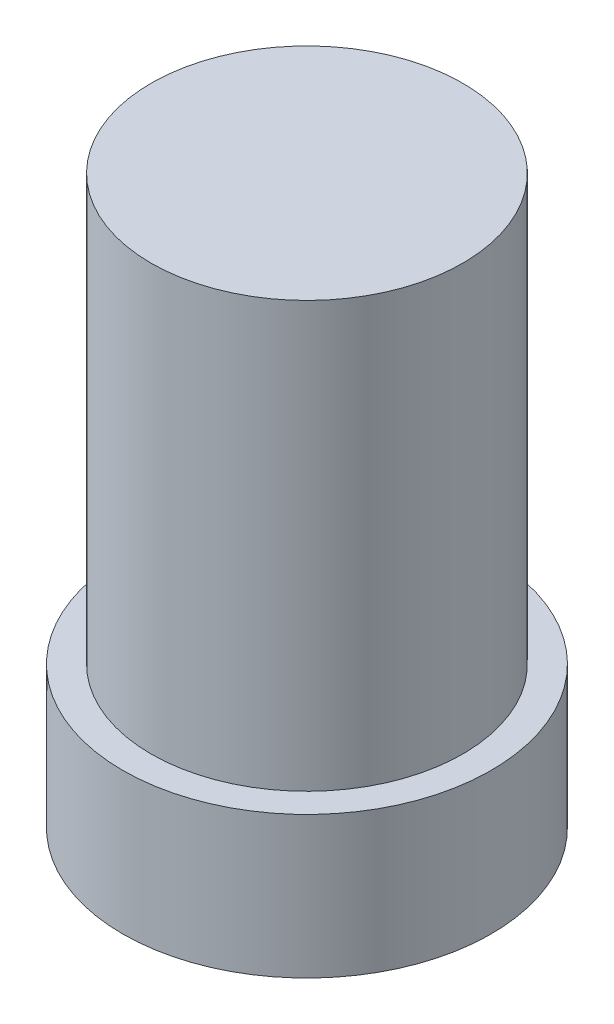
from build123d import *

# Parameters (mm, degrees)
SKETCH1_R           = 6.5
BOSS_EXTRUDE1_DEPTH = 5
SKETCH2_R           = 5.5
BOSS_EXTRUDE2_DEPTH = 15
SKETCH3_R           = 6
CUT_EXTRUDE1_DEPTH  = 4


with BuildPart() as part:
    # Sketch1 → Boss-Extrude1 (new body)
    with BuildSketch(Plane(origin=(0, 0, 0), x_dir=(1, 0, 0), z_dir=(0, 1, 0))):
        with Locations(Location((0, 0, 0), (0, 0, 270))):
            Circle(SKETCH1_R)
    extrude(amount=BOSS_EXTRUDE1_DEPTH)

    # Sketch2 → Boss-Extrude2 (add)
    with BuildSketch(Plane(origin=(0, 5, 0), x_dir=(1, 0, 0), z_dir=(0, 1, 0))):
        with Locations(Location((0, 0, 0), (0, 0, 270))):
            Circle(SKETCH2_R)
    extrude(amount=BOSS_EXTRUDE2_DEPTH)

    # Sketch3 → Cut-Extrude1 (cut)
    with BuildSketch(Plane.XZ):
        with Locations(Location((0, 0, 0), (0, 0, 270))):
            Circle(SKETCH3_R)
    extrude(amount=-CUT_EXTRUDE1_DEPTH, mode=Mode.SUBTRACT)


solid = part.part
